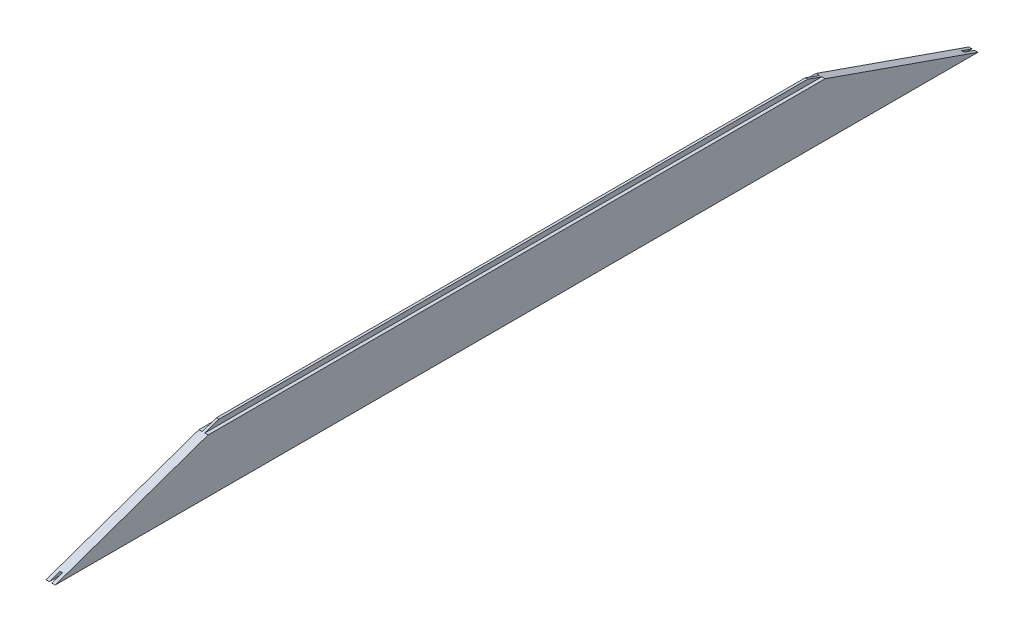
from build123d import *

# Parameters (mm, degrees)
ESQUISSE1_W                  = 4
ESQUISSE1_H                  = 8
BOSS_EXTRU_1_DEPTH           = 1500
ENL_V_MAT_EXTRU_1_DEPTH      = 1501.902561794
ENL_V_MAT_EXTRU_1_DEPTH_BACK = 1501.902561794


with BuildPart() as part:
    # Esquisse1 → Boss.-Extru.1 (new body)
    with BuildSketch(Plane.XY):
        Polygon((-2, 43.5), (-7.5, 43.5), (-7.5, -43.5), (-2, -43.5), (-2, -37.5), (2, -37.5), (2, -43.5), (7.5, -43.5), (7.5, 43.5), (2, 43.5), (2, 35.5), (-2, 35.5), align=None)
        with Locations((0, 39.5)):
            Rectangle(ESQUISSE1_W, ESQUISSE1_H)
        with Locations((0, 47.5)):
            Rectangle(ESQUISSE1_W, ESQUISSE1_H)
    extrude(amount=BOSS_EXTRU_1_DEPTH)

    # Esquisse2 → Enl_v. mat.-Extru.1 (cut, two sides: drawn at the far end of the back side and taken through both)
    with BuildSketch(Plane(origin=(0, 0, 0), x_dir=(0, 0, -1), z_dir=(1, 0, 0)).offset(-ENL_V_MAT_EXTRU_1_DEPTH_BACK)):
        Polygon((-1500, -43.5), (-1228.570726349, 51.5), (-1500, 51.5), align=None)
        Polygon((0, -43.5), (-271.429273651, 51.5), (0, 51.5), align=None)
    extrude(amount=ENL_V_MAT_EXTRU_1_DEPTH + ENL_V_MAT_EXTRU_1_DEPTH_BACK, mode=Mode.SUBTRACT)


solid = part.part
